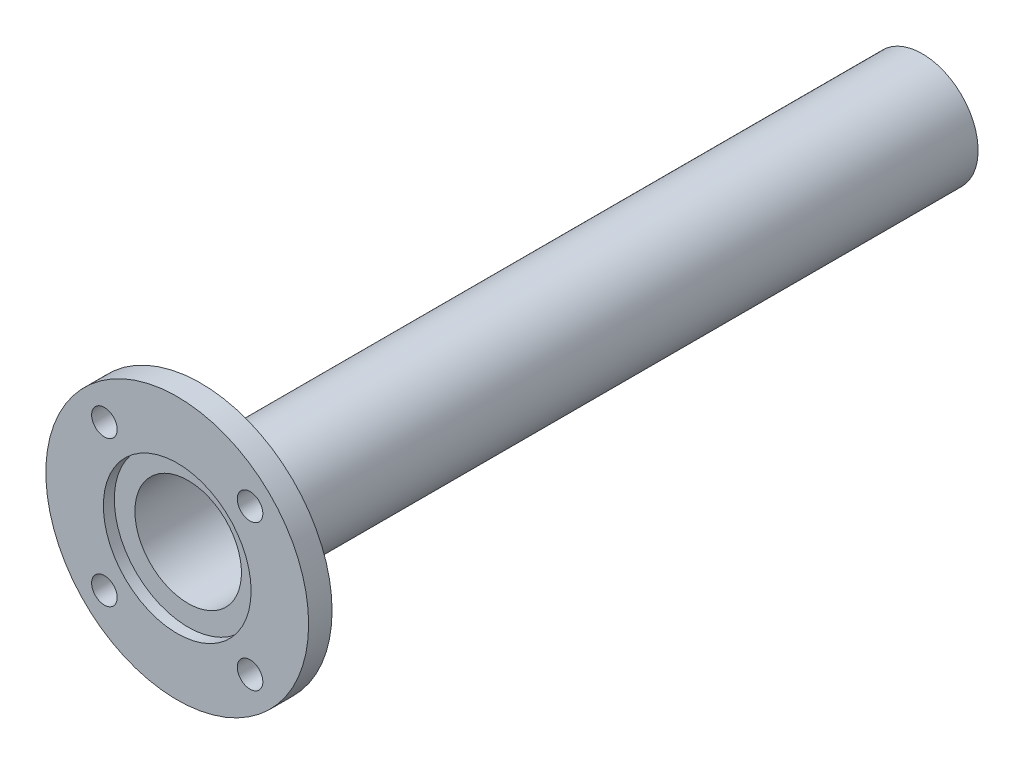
ISO-10303-21;
HEADER;
FILE_DESCRIPTION(('STEP AP214'),'2;1');
FILE_NAME('part.step','',(''),(''),'','','');
FILE_SCHEMA(('AUTOMOTIVE_DESIGN { 1 0 10303 214 1 1 1 1 }'));
ENDSEC;
DATA;
#1=APPLICATION_CONTEXT('core data for automotive mechanical design processes');
#2=APPLICATION_PROTOCOL_DEFINITION('international standard','automotive_design',2000,#1);
#3=PRODUCT_CONTEXT('',#1,'mechanical');
#4=PRODUCT('Part','Part','',(#3));
#5=PRODUCT_RELATED_PRODUCT_CATEGORY('part','',(#4));
#6=PRODUCT_DEFINITION_FORMATION('','',#4);
#7=PRODUCT_DEFINITION_CONTEXT('part definition',#1,'design');
#8=PRODUCT_DEFINITION('design','',#6,#7);
#9=PRODUCT_DEFINITION_SHAPE('','',#8);
#10=(LENGTH_UNIT() NAMED_UNIT(*) SI_UNIT(.MILLI.,.METRE.));
#11=(NAMED_UNIT(*) PLANE_ANGLE_UNIT() SI_UNIT($,.RADIAN.));
#12=(NAMED_UNIT(*) SI_UNIT($,.STERADIAN.) SOLID_ANGLE_UNIT());
#13=UNCERTAINTY_MEASURE_WITH_UNIT(LENGTH_MEASURE(1.E-05),#10,'distance_accuracy_value','');
#14=(GEOMETRIC_REPRESENTATION_CONTEXT(3) GLOBAL_UNCERTAINTY_ASSIGNED_CONTEXT((#13)) GLOBAL_UNIT_ASSIGNED_CONTEXT((#10,
#11,#12)) REPRESENTATION_CONTEXT('',''));
#15=CARTESIAN_POINT('',(0.,0.,0.));
#16=DIRECTION('',(0.,0.,1.));
#17=DIRECTION('',(1.,0.,0.));
#18=AXIS2_PLACEMENT_3D('',#15,#16,#17);
#19=CARTESIAN_POINT('',(93.609999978,-93.609999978,0.));
#20=DIRECTION('',(0.,0.,-1.));
#21=DIRECTION('',(-1.,0.,0.));
#22=AXIS2_PLACEMENT_3D('',#19,#20,#21);
#23=PLANE('',#22);
#24=CARTESIAN_POINT('',(0.,0.,0.));
#25=DIRECTION('',(0.,0.,1.));
#26=DIRECTION('',(1.,0.,0.));
#27=AXIS2_PLACEMENT_3D('',#24,#25,#26);
#28=CIRCLE('',#27,92.4999999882);
#29=CARTESIAN_POINT('',(92.4999999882,0.,0.));
#30=VERTEX_POINT('',#29);
#31=EDGE_CURVE('E40',#30,#30,#28,.F.);
#32=ORIENTED_EDGE('',*,*,#31,.T.);
#33=EDGE_LOOP('',(#32));
#34=FACE_BOUND('',#33,.T.);
#35=CARTESIAN_POINT('',(-51.26524164,51.26524164,0.));
#36=DIRECTION('',(0.,0.,-1.));
#37=DIRECTION('',(-1.,0.,0.));
#38=AXIS2_PLACEMENT_3D('',#35,#36,#37);
#39=CIRCLE('',#38,9.00000000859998);
#40=CARTESIAN_POINT('',(-60.2652416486,51.26524164,0.));
#41=VERTEX_POINT('',#40);
#42=EDGE_CURVE('E80',#41,#41,#39,.T.);
#43=ORIENTED_EDGE('',*,*,#42,.F.);
#44=EDGE_LOOP('',(#43));
#45=FACE_BOUND('',#44,.T.);
#46=CARTESIAN_POINT('',(-51.26524164,-51.26524164,0.));
#47=DIRECTION('',(0.,0.,-1.));
#48=DIRECTION('',(-1.,0.,0.));
#49=AXIS2_PLACEMENT_3D('',#46,#47,#48);
#50=CIRCLE('',#49,9.00000000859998);
#51=CARTESIAN_POINT('',(-60.2652416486,-51.26524164,0.));
#52=VERTEX_POINT('',#51);
#53=EDGE_CURVE('E78',#52,#52,#50,.T.);
#54=ORIENTED_EDGE('',*,*,#53,.F.);
#55=EDGE_LOOP('',(#54));
#56=FACE_BOUND('',#55,.T.);
#57=CARTESIAN_POINT('',(51.26524164,-51.26524164,0.));
#58=DIRECTION('',(0.,0.,-1.));
#59=DIRECTION('',(-1.,0.,0.));
#60=AXIS2_PLACEMENT_3D('',#57,#58,#59);
#61=CIRCLE('',#60,9.0000000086);
#62=CARTESIAN_POINT('',(42.2652416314,-51.26524164,0.));
#63=VERTEX_POINT('',#62);
#64=EDGE_CURVE('E75',#63,#63,#61,.T.);
#65=ORIENTED_EDGE('',*,*,#64,.F.);
#66=EDGE_LOOP('',(#65));
#67=FACE_BOUND('',#66,.T.);
#68=CARTESIAN_POINT('',(51.26524164,51.26524164,0.));
#69=DIRECTION('',(0.,0.,-1.));
#70=DIRECTION('',(-1.,0.,0.));
#71=AXIS2_PLACEMENT_3D('',#68,#69,#70);
#72=CIRCLE('',#71,9.0000000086);
#73=CARTESIAN_POINT('',(42.2652416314,51.26524164,0.));
#74=VERTEX_POINT('',#73);
#75=EDGE_CURVE('E72',#74,#74,#72,.T.);
#76=ORIENTED_EDGE('',*,*,#75,.F.);
#77=EDGE_LOOP('',(#76));
#78=FACE_BOUND('',#77,.T.);
#79=CARTESIAN_POINT('',(0.,0.,0.));
#80=DIRECTION('',(0.,0.,-1.));
#81=DIRECTION('',(-1.,0.,0.));
#82=AXIS2_PLACEMENT_3D('',#79,#80,#81);
#83=CIRCLE('',#82,39.3000000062);
#84=CARTESIAN_POINT('',(-39.3000000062,0.,0.));
#85=VERTEX_POINT('',#84);
#86=EDGE_CURVE('E52',#85,#85,#83,.T.);
#87=ORIENTED_EDGE('',*,*,#86,.F.);
#88=EDGE_LOOP('',(#87));
#89=FACE_BOUND('',#88,.T.);
#90=ADVANCED_FACE('F36',(#34,#45,#56,#67,#78,#89),#23,.T.);
#91=CARTESIAN_POINT('',(0.,0.,8.8000000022));
#92=DIRECTION('',(0.,0.,-1.));
#93=DIRECTION('',(-1.,0.,0.));
#94=AXIS2_PLACEMENT_3D('',#91,#92,#93);
#95=CYLINDRICAL_SURFACE('',#94,37.5000000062);
#96=CARTESIAN_POINT('',(0.,0.,8.8000000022));
#97=DIRECTION('',(0.,0.,-1.));
#98=DIRECTION('',(-1.,0.,0.));
#99=AXIS2_PLACEMENT_3D('',#96,#97,#98);
#100=CIRCLE('',#99,37.5000000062);
#101=CARTESIAN_POINT('',(-37.5000000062,0.,8.8000000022));
#102=VERTEX_POINT('',#101);
#103=EDGE_CURVE('E69',#102,#102,#100,.T.);
#104=ORIENTED_EDGE('',*,*,#103,.F.);
#105=EDGE_LOOP('',(#104));
#106=FACE_BOUND('',#105,.T.);
#107=CARTESIAN_POINT('',(0.,0.,-508.));
#108=DIRECTION('',(0.,0.,-1.));
#109=DIRECTION('',(-1.,0.,0.));
#110=AXIS2_PLACEMENT_3D('',#107,#108,#109);
#111=CIRCLE('',#110,37.5000000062);
#112=CARTESIAN_POINT('',(-37.5000000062,0.,-508.));
#113=VERTEX_POINT('',#112);
#114=EDGE_CURVE('E92',#113,#113,#111,.T.);
#115=ORIENTED_EDGE('',*,*,#114,.T.);
#116=EDGE_LOOP('',(#115));
#117=FACE_BOUND('',#116,.T.);
#118=ADVANCED_FACE('F97',(#106,#117),#95,.F.);
#119=CARTESIAN_POINT('',(0.,0.,0.));
#120=DIRECTION('',(0.,0.,1.));
#121=DIRECTION('',(1.,0.,0.));
#122=AXIS2_PLACEMENT_3D('',#119,#120,#121);
#123=CYLINDRICAL_SURFACE('',#122,92.4999999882);
#124=ORIENTED_EDGE('',*,*,#31,.F.);
#125=EDGE_LOOP('',(#124));
#126=FACE_BOUND('',#125,.T.);
#127=CARTESIAN_POINT('',(0.,0.,16.4999999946));
#128=DIRECTION('',(0.,0.,1.));
#129=DIRECTION('',(1.,0.,0.));
#130=AXIS2_PLACEMENT_3D('',#127,#128,#129);
#131=CIRCLE('',#130,92.4999999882);
#132=CARTESIAN_POINT('',(92.4999999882,0.,16.4999999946));
#133=VERTEX_POINT('',#132);
#134=EDGE_CURVE('E66',#133,#133,#131,.F.);
#135=ORIENTED_EDGE('',*,*,#134,.T.);
#136=EDGE_LOOP('',(#135));
#137=FACE_BOUND('',#136,.T.);
#138=ADVANCED_FACE('F112',(#126,#137),#123,.T.);
#139=CARTESIAN_POINT('',(-51.26524164,51.26524164,16.4999999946));
#140=DIRECTION('',(0.,0.,-1.));
#141=DIRECTION('',(-1.,0.,0.));
#142=AXIS2_PLACEMENT_3D('',#139,#140,#141);
#143=CYLINDRICAL_SURFACE('',#142,9.00000000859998);
#144=ORIENTED_EDGE('',*,*,#42,.T.);
#145=EDGE_LOOP('',(#144));
#146=FACE_BOUND('',#145,.T.);
#147=CARTESIAN_POINT('',(-51.26524164,51.26524164,16.4999999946));
#148=DIRECTION('',(0.,0.,-1.));
#149=DIRECTION('',(-1.,0.,0.));
#150=AXIS2_PLACEMENT_3D('',#147,#148,#149);
#151=CIRCLE('',#150,9.00000000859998);
#152=CARTESIAN_POINT('',(-60.2652416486,51.26524164,16.4999999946));
#153=VERTEX_POINT('',#152);
#154=EDGE_CURVE('E63',#153,#153,#151,.F.);
#155=ORIENTED_EDGE('',*,*,#154,.T.);
#156=EDGE_LOOP('',(#155));
#157=FACE_BOUND('',#156,.T.);
#158=ADVANCED_FACE('F147',(#146,#157),#143,.F.);
#159=CARTESIAN_POINT('',(-51.26524164,-51.26524164,16.4999999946));
#160=DIRECTION('',(0.,0.,-1.));
#161=DIRECTION('',(-1.,0.,0.));
#162=AXIS2_PLACEMENT_3D('',#159,#160,#161);
#163=CYLINDRICAL_SURFACE('',#162,9.00000000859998);
#164=ORIENTED_EDGE('',*,*,#53,.T.);
#165=EDGE_LOOP('',(#164));
#166=FACE_BOUND('',#165,.T.);
#167=CARTESIAN_POINT('',(-51.26524164,-51.26524164,16.4999999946));
#168=DIRECTION('',(0.,0.,-1.));
#169=DIRECTION('',(-1.,0.,0.));
#170=AXIS2_PLACEMENT_3D('',#167,#168,#169);
#171=CIRCLE('',#170,9.00000000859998);
#172=CARTESIAN_POINT('',(-60.2652416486,-51.26524164,16.4999999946));
#173=VERTEX_POINT('',#172);
#174=EDGE_CURVE('E60',#173,#173,#171,.F.);
#175=ORIENTED_EDGE('',*,*,#174,.T.);
#176=EDGE_LOOP('',(#175));
#177=FACE_BOUND('',#176,.T.);
#178=ADVANCED_FACE('F140',(#166,#177),#163,.F.);
#179=CARTESIAN_POINT('',(51.26524164,-51.26524164,16.4999999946));
#180=DIRECTION('',(0.,0.,-1.));
#181=DIRECTION('',(-1.,0.,0.));
#182=AXIS2_PLACEMENT_3D('',#179,#180,#181);
#183=CYLINDRICAL_SURFACE('',#182,9.0000000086);
#184=ORIENTED_EDGE('',*,*,#64,.T.);
#185=EDGE_LOOP('',(#184));
#186=FACE_BOUND('',#185,.T.);
#187=CARTESIAN_POINT('',(51.26524164,-51.26524164,16.4999999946));
#188=DIRECTION('',(0.,0.,-1.));
#189=DIRECTION('',(-1.,0.,0.));
#190=AXIS2_PLACEMENT_3D('',#187,#188,#189);
#191=CIRCLE('',#190,9.0000000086);
#192=CARTESIAN_POINT('',(42.2652416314,-51.26524164,16.4999999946));
#193=VERTEX_POINT('',#192);
#194=EDGE_CURVE('E57',#193,#193,#191,.F.);
#195=ORIENTED_EDGE('',*,*,#194,.T.);
#196=EDGE_LOOP('',(#195));
#197=FACE_BOUND('',#196,.T.);
#198=ADVANCED_FACE('F130',(#186,#197),#183,.F.);
#199=CARTESIAN_POINT('',(51.26524164,51.26524164,16.4999999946));
#200=DIRECTION('',(0.,0.,-1.));
#201=DIRECTION('',(-1.,0.,0.));
#202=AXIS2_PLACEMENT_3D('',#199,#200,#201);
#203=CYLINDRICAL_SURFACE('',#202,9.0000000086);
#204=ORIENTED_EDGE('',*,*,#75,.T.);
#205=EDGE_LOOP('',(#204));
#206=FACE_BOUND('',#205,.T.);
#207=CARTESIAN_POINT('',(51.26524164,51.26524164,16.4999999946));
#208=DIRECTION('',(0.,0.,-1.));
#209=DIRECTION('',(-1.,0.,0.));
#210=AXIS2_PLACEMENT_3D('',#207,#208,#209);
#211=CIRCLE('',#210,9.0000000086);
#212=CARTESIAN_POINT('',(42.2652416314,51.26524164,16.4999999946));
#213=VERTEX_POINT('',#212);
#214=EDGE_CURVE('E49',#213,#213,#211,.F.);
#215=ORIENTED_EDGE('',*,*,#214,.T.);
#216=EDGE_LOOP('',(#215));
#217=FACE_BOUND('',#216,.T.);
#218=ADVANCED_FACE('F123',(#206,#217),#203,.F.);
#219=CARTESIAN_POINT('',(-52.6239999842,-52.6239999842,8.8000000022));
#220=DIRECTION('',(0.,0.,1.));
#221=DIRECTION('',(1.,0.,0.));
#222=AXIS2_PLACEMENT_3D('',#219,#220,#221);
#223=PLANE('',#222);
#224=ORIENTED_EDGE('',*,*,#103,.T.);
#225=EDGE_LOOP('',(#224));
#226=FACE_BOUND('',#225,.T.);
#227=CARTESIAN_POINT('',(0.,0.,8.8000000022));
#228=DIRECTION('',(0.,0.,1.));
#229=DIRECTION('',(1.,0.,0.));
#230=AXIS2_PLACEMENT_3D('',#227,#228,#229);
#231=CIRCLE('',#230,51.9999999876);
#232=CARTESIAN_POINT('',(51.9999999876,0.,8.8000000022));
#233=VERTEX_POINT('',#232);
#234=EDGE_CURVE('E44',#233,#233,#231,.F.);
#235=ORIENTED_EDGE('',*,*,#234,.F.);
#236=EDGE_LOOP('',(#235));
#237=FACE_BOUND('',#236,.T.);
#238=ADVANCED_FACE('F121',(#226,#237),#223,.T.);
#239=CARTESIAN_POINT('',(93.609999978,-93.609999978,16.4999999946));
#240=DIRECTION('',(0.,0.,-1.));
#241=DIRECTION('',(-1.,0.,0.));
#242=AXIS2_PLACEMENT_3D('',#239,#240,#241);
#243=PLANE('',#242);
#244=CARTESIAN_POINT('',(0.,0.,16.4999999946));
#245=DIRECTION('',(0.,0.,1.));
#246=DIRECTION('',(1.,0.,0.));
#247=AXIS2_PLACEMENT_3D('',#244,#245,#246);
#248=CIRCLE('',#247,51.9999999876);
#249=CARTESIAN_POINT('',(51.9999999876,0.,16.4999999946));
#250=VERTEX_POINT('',#249);
#251=EDGE_CURVE('E11',#250,#250,#248,.T.);
#252=ORIENTED_EDGE('',*,*,#251,.F.);
#253=EDGE_LOOP('',(#252));
#254=FACE_BOUND('',#253,.T.);
#255=ORIENTED_EDGE('',*,*,#214,.F.);
#256=EDGE_LOOP('',(#255));
#257=FACE_BOUND('',#256,.T.);
#258=ORIENTED_EDGE('',*,*,#194,.F.);
#259=EDGE_LOOP('',(#258));
#260=FACE_BOUND('',#259,.T.);
#261=ORIENTED_EDGE('',*,*,#174,.F.);
#262=EDGE_LOOP('',(#261));
#263=FACE_BOUND('',#262,.T.);
#264=ORIENTED_EDGE('',*,*,#154,.F.);
#265=EDGE_LOOP('',(#264));
#266=FACE_BOUND('',#265,.T.);
#267=ORIENTED_EDGE('',*,*,#134,.F.);
#268=EDGE_LOOP('',(#267));
#269=FACE_BOUND('',#268,.T.);
#270=ADVANCED_FACE('F38',(#254,#257,#260,#263,#266,#269),#243,.F.);
#271=CARTESIAN_POINT('',(0.,0.,8.8000000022));
#272=DIRECTION('',(0.,0.,1.));
#273=DIRECTION('',(1.,0.,0.));
#274=AXIS2_PLACEMENT_3D('',#271,#272,#273);
#275=CYLINDRICAL_SURFACE('',#274,51.9999999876);
#276=ORIENTED_EDGE('',*,*,#251,.T.);
#277=EDGE_LOOP('',(#276));
#278=FACE_BOUND('',#277,.T.);
#279=ORIENTED_EDGE('',*,*,#234,.T.);
#280=EDGE_LOOP('',(#279));
#281=FACE_BOUND('',#280,.T.);
#282=ADVANCED_FACE('F102',(#278,#281),#275,.F.);
#283=CARTESIAN_POINT('',(0.,0.,-508.));
#284=DIRECTION('',(0.,0.,-1.));
#285=DIRECTION('',(-1.,0.,0.));
#286=AXIS2_PLACEMENT_3D('',#283,#284,#285);
#287=PLANE('',#286);
#288=CARTESIAN_POINT('',(0.,0.,-508.));
#289=DIRECTION('',(0.,0.,-1.));
#290=DIRECTION('',(-1.,0.,0.));
#291=AXIS2_PLACEMENT_3D('',#288,#289,#290);
#292=CIRCLE('',#291,39.3000000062);
#293=CARTESIAN_POINT('',(-39.3000000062,0.,-508.));
#294=VERTEX_POINT('',#293);
#295=EDGE_CURVE('E85',#294,#294,#292,.T.);
#296=ORIENTED_EDGE('',*,*,#295,.T.);
#297=EDGE_LOOP('',(#296));
#298=FACE_BOUND('',#297,.T.);
#299=ORIENTED_EDGE('',*,*,#114,.F.);
#300=EDGE_LOOP('',(#299));
#301=FACE_BOUND('',#300,.T.);
#302=ADVANCED_FACE('F99',(#298,#301),#287,.T.);
#303=CARTESIAN_POINT('',(0.,0.,-508.));
#304=DIRECTION('',(0.,0.,1.));
#305=DIRECTION('',(1.,0.,0.));
#306=AXIS2_PLACEMENT_3D('',#303,#304,#305);
#307=CYLINDRICAL_SURFACE('',#306,39.3000000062);
#308=ORIENTED_EDGE('',*,*,#295,.F.);
#309=EDGE_LOOP('',(#308));
#310=FACE_BOUND('',#309,.T.);
#311=ORIENTED_EDGE('',*,*,#86,.T.);
#312=EDGE_LOOP('',(#311));
#313=FACE_BOUND('',#312,.T.);
#314=ADVANCED_FACE('F101',(#310,#313),#307,.T.);
#315=CLOSED_SHELL('',(#90,#118,#138,#158,#178,#198,#218,#238,#270,#282,#302,#314));
#316=MANIFOLD_SOLID_BREP('B2',#315);
#317=ADVANCED_BREP_SHAPE_REPRESENTATION('',(#18,#316),#14);
#318=SHAPE_DEFINITION_REPRESENTATION(#9,#317);
ENDSEC;
END-ISO-10303-21;
